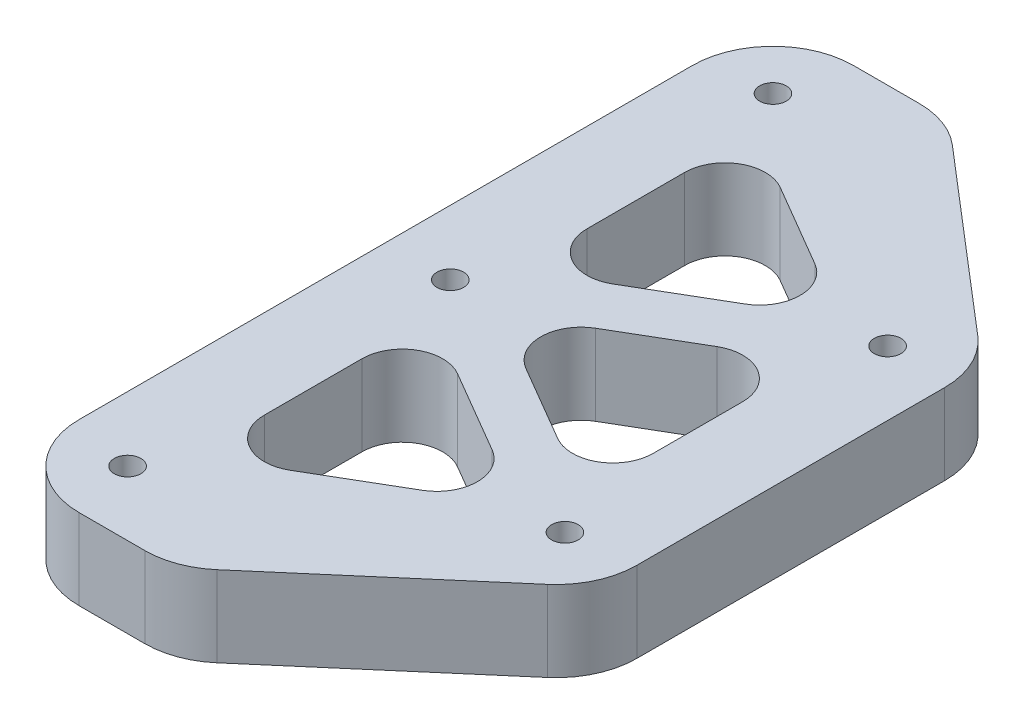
ISO-10303-21;
HEADER;
FILE_DESCRIPTION(('STEP AP214'),'2;1');
FILE_NAME('part.step','',(''),(''),'','','');
FILE_SCHEMA(('AUTOMOTIVE_DESIGN { 1 0 10303 214 1 1 1 1 }'));
ENDSEC;
DATA;
#1=APPLICATION_CONTEXT('core data for automotive mechanical design processes');
#2=APPLICATION_PROTOCOL_DEFINITION('international standard','automotive_design',2000,#1);
#3=PRODUCT_CONTEXT('',#1,'mechanical');
#4=PRODUCT('Part','Part','',(#3));
#5=PRODUCT_RELATED_PRODUCT_CATEGORY('part','',(#4));
#6=PRODUCT_DEFINITION_FORMATION('','',#4);
#7=PRODUCT_DEFINITION_CONTEXT('part definition',#1,'design');
#8=PRODUCT_DEFINITION('design','',#6,#7);
#9=PRODUCT_DEFINITION_SHAPE('','',#8);
#10=(LENGTH_UNIT() NAMED_UNIT(*) SI_UNIT(.MILLI.,.METRE.));
#11=(NAMED_UNIT(*) PLANE_ANGLE_UNIT() SI_UNIT($,.RADIAN.));
#12=(NAMED_UNIT(*) SI_UNIT($,.STERADIAN.) SOLID_ANGLE_UNIT());
#13=UNCERTAINTY_MEASURE_WITH_UNIT(LENGTH_MEASURE(1.E-05),#10,'distance_accuracy_value','');
#14=(GEOMETRIC_REPRESENTATION_CONTEXT(3) GLOBAL_UNCERTAINTY_ASSIGNED_CONTEXT((#13)) GLOBAL_UNIT_ASSIGNED_CONTEXT((#10,
#11,#12)) REPRESENTATION_CONTEXT('',''));
#15=CARTESIAN_POINT('',(0.,0.,0.));
#16=DIRECTION('',(0.,0.,1.));
#17=DIRECTION('',(1.,0.,0.));
#18=AXIS2_PLACEMENT_3D('',#15,#16,#17);
#19=CARTESIAN_POINT('',(17.,0.,-98.));
#20=DIRECTION('',(0.,1.,0.));
#21=DIRECTION('',(0.,0.,1.));
#22=AXIS2_PLACEMENT_3D('',#19,#20,#21);
#23=CYLINDRICAL_SURFACE('',#22,10.);
#24=CARTESIAN_POINT('',(17.,0.,-98.));
#25=DIRECTION('',(0.,-1.,0.));
#26=DIRECTION('',(0.,0.,-1.));
#27=AXIS2_PLACEMENT_3D('',#24,#25,#26);
#28=CIRCLE('',#27,10.);
#29=CARTESIAN_POINT('',(7.,0.,-98.));
#30=VERTEX_POINT('',#29);
#31=CARTESIAN_POINT('',(17.,0.,-108.));
#32=VERTEX_POINT('',#31);
#33=EDGE_CURVE('E409',#30,#32,#28,.T.);
#34=ORIENTED_EDGE('',*,*,#33,.F.);
#35=DIRECTION('',(0.,-1.,0.));
#36=VECTOR('',#35,1.);
#37=CARTESIAN_POINT('',(7.,0.,-98.));
#38=LINE('',#37,#36);
#39=CARTESIAN_POINT('',(7.,10.,-98.));
#40=VERTEX_POINT('',#39);
#41=EDGE_CURVE('E484',#40,#30,#38,.T.);
#42=ORIENTED_EDGE('',*,*,#41,.F.);
#43=CARTESIAN_POINT('',(17.,10.,-98.));
#44=DIRECTION('',(0.,1.,0.));
#45=DIRECTION('',(0.,0.,-1.));
#46=AXIS2_PLACEMENT_3D('',#43,#44,#45);
#47=CIRCLE('',#46,10.);
#48=CARTESIAN_POINT('',(17.,10.,-108.));
#49=VERTEX_POINT('',#48);
#50=EDGE_CURVE('E329',#49,#40,#47,.T.);
#51=ORIENTED_EDGE('',*,*,#50,.F.);
#52=DIRECTION('',(0.,1.,0.));
#53=VECTOR('',#52,1.);
#54=CARTESIAN_POINT('',(17.,0.,-108.));
#55=LINE('',#54,#53);
#56=EDGE_CURVE('E430',#32,#49,#55,.T.);
#57=ORIENTED_EDGE('',*,*,#56,.F.);
#58=EDGE_LOOP('',(#34,#42,#51,#57));
#59=FACE_BOUND('',#58,.T.);
#60=ADVANCED_FACE('F17',(#59),#23,.T.);
#61=CARTESIAN_POINT('',(25.1405946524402,0.,-98.));
#62=DIRECTION('',(0.,1.,0.));
#63=DIRECTION('',(0.,0.,1.));
#64=AXIS2_PLACEMENT_3D('',#61,#62,#63);
#65=CYLINDRICAL_SURFACE('',#64,10.);
#66=CARTESIAN_POINT('',(25.1405946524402,0.,-98.));
#67=DIRECTION('',(0.,-1.,0.));
#68=DIRECTION('',(0.,0.,-1.));
#69=AXIS2_PLACEMENT_3D('',#66,#67,#68);
#70=CIRCLE('',#69,10.);
#71=CARTESIAN_POINT('',(25.1405946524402,0.,-108.));
#72=VERTEX_POINT('',#71);
#73=CARTESIAN_POINT('',(31.6485083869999,0.,-105.592566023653));
#74=VERTEX_POINT('',#73);
#75=EDGE_CURVE('E417',#72,#74,#70,.T.);
#76=ORIENTED_EDGE('',*,*,#75,.F.);
#77=DIRECTION('',(0.,-1.,0.));
#78=VECTOR('',#77,1.);
#79=CARTESIAN_POINT('',(25.1405946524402,0.,-108.));
#80=LINE('',#79,#78);
#81=CARTESIAN_POINT('',(25.1405946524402,10.,-108.));
#82=VERTEX_POINT('',#81);
#83=EDGE_CURVE('E434',#82,#72,#80,.T.);
#84=ORIENTED_EDGE('',*,*,#83,.F.);
#85=CARTESIAN_POINT('',(25.1405946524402,10.,-98.));
#86=DIRECTION('',(0.,1.,0.));
#87=DIRECTION('',(0.,0.,-1.));
#88=AXIS2_PLACEMENT_3D('',#85,#86,#87);
#89=CIRCLE('',#88,10.);
#90=CARTESIAN_POINT('',(31.6485083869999,10.,-105.592566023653));
#91=VERTEX_POINT('',#90);
#92=EDGE_CURVE('E514',#91,#82,#89,.T.);
#93=ORIENTED_EDGE('',*,*,#92,.F.);
#94=DIRECTION('',(0.,1.,0.));
#95=VECTOR('',#94,1.);
#96=CARTESIAN_POINT('',(31.6485083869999,0.,-105.592566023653));
#97=LINE('',#96,#95);
#98=EDGE_CURVE('E346',#74,#91,#97,.T.);
#99=ORIENTED_EDGE('',*,*,#98,.F.);
#100=EDGE_LOOP('',(#76,#84,#93,#99));
#101=FACE_BOUND('',#100,.T.);
#102=ADVANCED_FACE('F19',(#101),#65,.T.);
#103=CARTESIAN_POINT('',(47.2137761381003,0.,-79.0801301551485));
#104=DIRECTION('',(0.,1.,0.));
#105=DIRECTION('',(0.,0.,1.));
#106=AXIS2_PLACEMENT_3D('',#103,#104,#105);
#107=CYLINDRICAL_SURFACE('',#106,10.);
#108=CARTESIAN_POINT('',(47.2137761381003,0.,-79.0801301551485));
#109=DIRECTION('',(0.,-1.,0.));
#110=DIRECTION('',(0.,0.,-1.));
#111=AXIS2_PLACEMENT_3D('',#108,#109,#110);
#112=CIRCLE('',#111,10.);
#113=CARTESIAN_POINT('',(53.72168987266,0.,-86.6726961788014));
#114=VERTEX_POINT('',#113);
#115=CARTESIAN_POINT('',(57.2137761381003,0.,-79.0801301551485));
#116=VERTEX_POINT('',#115);
#117=EDGE_CURVE('E422',#114,#116,#112,.T.);
#118=ORIENTED_EDGE('',*,*,#117,.F.);
#119=DIRECTION('',(0.,-1.,0.));
#120=VECTOR('',#119,1.);
#121=CARTESIAN_POINT('',(53.72168987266,0.,-86.6726961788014));
#122=LINE('',#121,#120);
#123=CARTESIAN_POINT('',(53.72168987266,10.,-86.6726961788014));
#124=VERTEX_POINT('',#123);
#125=EDGE_CURVE('E433',#124,#114,#122,.T.);
#126=ORIENTED_EDGE('',*,*,#125,.F.);
#127=CARTESIAN_POINT('',(47.2137761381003,10.,-79.0801301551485));
#128=DIRECTION('',(0.,1.,0.));
#129=DIRECTION('',(0.,0.,-1.));
#130=AXIS2_PLACEMENT_3D('',#127,#128,#129);
#131=CIRCLE('',#130,10.);
#132=CARTESIAN_POINT('',(57.2137761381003,10.,-79.0801301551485));
#133=VERTEX_POINT('',#132);
#134=EDGE_CURVE('E505',#133,#124,#131,.T.);
#135=ORIENTED_EDGE('',*,*,#134,.F.);
#136=DIRECTION('',(0.,1.,0.));
#137=VECTOR('',#136,1.);
#138=CARTESIAN_POINT('',(57.2137761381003,0.,-79.0801301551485));
#139=LINE('',#138,#137);
#140=EDGE_CURVE('E11',#116,#133,#139,.T.);
#141=ORIENTED_EDGE('',*,*,#140,.F.);
#142=EDGE_LOOP('',(#118,#126,#135,#141));
#143=FACE_BOUND('',#142,.T.);
#144=ADVANCED_FACE('F628',(#143),#107,.T.);
#145=CARTESIAN_POINT('',(47.2137761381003,0.,-40.9198698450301));
#146=DIRECTION('',(0.,1.,0.));
#147=DIRECTION('',(0.,0.,1.));
#148=AXIS2_PLACEMENT_3D('',#145,#146,#147);
#149=CYLINDRICAL_SURFACE('',#148,10.);
#150=CARTESIAN_POINT('',(47.2137761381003,0.,-40.9198698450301));
#151=DIRECTION('',(0.,-1.,0.));
#152=DIRECTION('',(0.,0.,-1.));
#153=AXIS2_PLACEMENT_3D('',#150,#151,#152);
#154=CIRCLE('',#153,10.);
#155=CARTESIAN_POINT('',(57.2137761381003,0.,-40.9198698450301));
#156=VERTEX_POINT('',#155);
#157=CARTESIAN_POINT('',(53.72168987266,0.,-33.3273038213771));
#158=VERTEX_POINT('',#157);
#159=EDGE_CURVE('E439',#156,#158,#154,.T.);
#160=ORIENTED_EDGE('',*,*,#159,.F.);
#161=DIRECTION('',(0.,-1.,0.));
#162=VECTOR('',#161,1.);
#163=CARTESIAN_POINT('',(57.2137761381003,0.,-40.9198698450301));
#164=LINE('',#163,#162);
#165=CARTESIAN_POINT('',(57.2137761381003,10.,-40.9198698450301));
#166=VERTEX_POINT('',#165);
#167=EDGE_CURVE('E26',#166,#156,#164,.T.);
#168=ORIENTED_EDGE('',*,*,#167,.F.);
#169=CARTESIAN_POINT('',(47.2137761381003,10.,-40.9198698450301));
#170=DIRECTION('',(0.,1.,0.));
#171=DIRECTION('',(0.,0.,-1.));
#172=AXIS2_PLACEMENT_3D('',#169,#170,#171);
#173=CIRCLE('',#172,10.);
#174=CARTESIAN_POINT('',(53.72168987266,10.,-33.3273038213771));
#175=VERTEX_POINT('',#174);
#176=EDGE_CURVE('E501',#175,#166,#173,.T.);
#177=ORIENTED_EDGE('',*,*,#176,.F.);
#178=DIRECTION('',(0.,1.,0.));
#179=VECTOR('',#178,1.);
#180=CARTESIAN_POINT('',(53.72168987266,0.,-33.3273038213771));
#181=LINE('',#180,#179);
#182=EDGE_CURVE('E399',#158,#175,#181,.T.);
#183=ORIENTED_EDGE('',*,*,#182,.F.);
#184=EDGE_LOOP('',(#160,#168,#177,#183));
#185=FACE_BOUND('',#184,.T.);
#186=ADVANCED_FACE('F622',(#185),#149,.T.);
#187=CARTESIAN_POINT('',(25.1405946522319,0.,-22.));
#188=DIRECTION('',(0.,1.,0.));
#189=DIRECTION('',(0.,0.,1.));
#190=AXIS2_PLACEMENT_3D('',#187,#188,#189);
#191=CYLINDRICAL_SURFACE('',#190,10.);
#192=CARTESIAN_POINT('',(25.1405946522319,0.,-22.));
#193=DIRECTION('',(0.,-1.,0.));
#194=DIRECTION('',(0.,0.,-1.));
#195=AXIS2_PLACEMENT_3D('',#192,#193,#194);
#196=CIRCLE('',#195,10.);
#197=CARTESIAN_POINT('',(31.6485083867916,0.,-14.407433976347));
#198=VERTEX_POINT('',#197);
#199=CARTESIAN_POINT('',(25.1405946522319,0.,-12.));
#200=VERTEX_POINT('',#199);
#201=EDGE_CURVE('E389',#198,#200,#196,.T.);
#202=ORIENTED_EDGE('',*,*,#201,.F.);
#203=DIRECTION('',(0.,-1.,0.));
#204=VECTOR('',#203,1.);
#205=CARTESIAN_POINT('',(31.6485083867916,0.,-14.407433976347));
#206=LINE('',#205,#204);
#207=CARTESIAN_POINT('',(31.6485083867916,10.,-14.407433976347));
#208=VERTEX_POINT('',#207);
#209=EDGE_CURVE('E478',#208,#198,#206,.T.);
#210=ORIENTED_EDGE('',*,*,#209,.F.);
#211=CARTESIAN_POINT('',(25.1405946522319,10.,-22.));
#212=DIRECTION('',(0.,1.,0.));
#213=DIRECTION('',(0.,0.,-1.));
#214=AXIS2_PLACEMENT_3D('',#211,#212,#213);
#215=CIRCLE('',#214,10.);
#216=CARTESIAN_POINT('',(25.1405946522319,10.,-12.));
#217=VERTEX_POINT('',#216);
#218=EDGE_CURVE('E603',#217,#208,#215,.T.);
#219=ORIENTED_EDGE('',*,*,#218,.F.);
#220=DIRECTION('',(0.,1.,0.));
#221=VECTOR('',#220,1.);
#222=CARTESIAN_POINT('',(25.1405946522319,0.,-12.));
#223=LINE('',#222,#221);
#224=EDGE_CURVE('E398',#200,#217,#223,.T.);
#225=ORIENTED_EDGE('',*,*,#224,.F.);
#226=EDGE_LOOP('',(#202,#210,#219,#225));
#227=FACE_BOUND('',#226,.T.);
#228=ADVANCED_FACE('F1615',(#227),#191,.T.);
#229=CARTESIAN_POINT('',(17.,0.,-22.));
#230=DIRECTION('',(0.,1.,0.));
#231=DIRECTION('',(0.,0.,1.));
#232=AXIS2_PLACEMENT_3D('',#229,#230,#231);
#233=CYLINDRICAL_SURFACE('',#232,10.);
#234=CARTESIAN_POINT('',(17.,0.,-22.));
#235=DIRECTION('',(0.,-1.,0.));
#236=DIRECTION('',(0.,0.,-1.));
#237=AXIS2_PLACEMENT_3D('',#234,#235,#236);
#238=CIRCLE('',#237,10.);
#239=CARTESIAN_POINT('',(17.,0.,-12.));
#240=VERTEX_POINT('',#239);
#241=CARTESIAN_POINT('',(7.,0.,-22.));
#242=VERTEX_POINT('',#241);
#243=EDGE_CURVE('E404',#240,#242,#238,.T.);
#244=ORIENTED_EDGE('',*,*,#243,.F.);
#245=DIRECTION('',(0.,-1.,0.));
#246=VECTOR('',#245,1.);
#247=CARTESIAN_POINT('',(17.,0.,-12.));
#248=LINE('',#247,#246);
#249=CARTESIAN_POINT('',(17.,10.,-12.));
#250=VERTEX_POINT('',#249);
#251=EDGE_CURVE('E395',#250,#240,#248,.T.);
#252=ORIENTED_EDGE('',*,*,#251,.F.);
#253=CARTESIAN_POINT('',(17.,10.,-22.));
#254=DIRECTION('',(0.,1.,0.));
#255=DIRECTION('',(0.,0.,-1.));
#256=AXIS2_PLACEMENT_3D('',#253,#254,#255);
#257=CIRCLE('',#256,10.);
#258=CARTESIAN_POINT('',(7.,10.,-22.));
#259=VERTEX_POINT('',#258);
#260=EDGE_CURVE('E592',#259,#250,#257,.T.);
#261=ORIENTED_EDGE('',*,*,#260,.F.);
#262=DIRECTION('',(0.,1.,0.));
#263=VECTOR('',#262,1.);
#264=CARTESIAN_POINT('',(7.,0.,-22.));
#265=LINE('',#264,#263);
#266=EDGE_CURVE('E481',#242,#259,#265,.T.);
#267=ORIENTED_EDGE('',*,*,#266,.F.);
#268=EDGE_LOOP('',(#244,#252,#261,#267));
#269=FACE_BOUND('',#268,.T.);
#270=ADVANCED_FACE('F641',(#269),#233,.T.);
#271=CARTESIAN_POINT('',(57.2137761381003,0.,-36.320520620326));
#272=DIRECTION('',(1.,0.,0.));
#273=DIRECTION('',(0.,1.,0.));
#274=AXIS2_PLACEMENT_3D('',#271,#272,#273);
#275=PLANE('',#274);
#276=DIRECTION('',(0.,0.,-1.));
#277=VECTOR('',#276,1.);
#278=CARTESIAN_POINT('',(57.2137761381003,10.,-36.320520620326));
#279=LINE('',#278,#277);
#280=EDGE_CURVE('E510',#166,#133,#279,.T.);
#281=ORIENTED_EDGE('',*,*,#280,.F.);
#282=ORIENTED_EDGE('',*,*,#167,.T.);
#283=DIRECTION('',(0.,0.,-1.));
#284=VECTOR('',#283,1.);
#285=CARTESIAN_POINT('',(57.2137761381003,0.,-36.320520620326));
#286=LINE('',#285,#284);
#287=EDGE_CURVE('E429',#156,#116,#286,.T.);
#288=ORIENTED_EDGE('',*,*,#287,.T.);
#289=ORIENTED_EDGE('',*,*,#140,.T.);
#290=EDGE_LOOP('',(#281,#282,#288,#289));
#291=FACE_BOUND('',#290,.T.);
#292=ADVANCED_FACE('F625',(#291),#275,.T.);
#293=CARTESIAN_POINT('',(57.2137761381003,0.,-83.6794793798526));
#294=DIRECTION('',(0.650791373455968,0.,-0.759256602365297));
#295=DIRECTION('',(0.,-1.,0.));
#296=AXIS2_PLACEMENT_3D('',#293,#294,#295);
#297=PLANE('',#296);
#298=DIRECTION('',(-0.759256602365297,0.,-0.650791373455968));
#299=VECTOR('',#298,1.);
#300=CARTESIAN_POINT('',(57.2137761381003,10.,-83.6794793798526));
#301=LINE('',#300,#299);
#302=EDGE_CURVE('E509',#124,#91,#301,.T.);
#303=ORIENTED_EDGE('',*,*,#302,.F.);
#304=ORIENTED_EDGE('',*,*,#125,.T.);
#305=DIRECTION('',(-0.759256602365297,0.,-0.650791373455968));
#306=VECTOR('',#305,1.);
#307=CARTESIAN_POINT('',(57.2137761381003,0.,-83.6794793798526));
#308=LINE('',#307,#306);
#309=EDGE_CURVE('E418',#114,#74,#308,.T.);
#310=ORIENTED_EDGE('',*,*,#309,.T.);
#311=ORIENTED_EDGE('',*,*,#98,.T.);
#312=EDGE_LOOP('',(#303,#304,#310,#311));
#313=FACE_BOUND('',#312,.T.);
#314=ADVANCED_FACE('F629',(#313),#297,.T.);
#315=CARTESIAN_POINT('',(28.839835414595,0.,-108.));
#316=DIRECTION('',(0.,0.,-1.));
#317=DIRECTION('',(0.,-1.,0.));
#318=AXIS2_PLACEMENT_3D('',#315,#316,#317);
#319=PLANE('',#318);
#320=DIRECTION('',(-1.,0.,0.));
#321=VECTOR('',#320,1.);
#322=CARTESIAN_POINT('',(28.839835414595,10.,-108.));
#323=LINE('',#322,#321);
#324=EDGE_CURVE('E339',#82,#49,#323,.T.);
#325=ORIENTED_EDGE('',*,*,#324,.F.);
#326=ORIENTED_EDGE('',*,*,#83,.T.);
#327=DIRECTION('',(-1.,0.,0.));
#328=VECTOR('',#327,1.);
#329=CARTESIAN_POINT('',(28.839835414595,0.,-108.));
#330=LINE('',#329,#328);
#331=EDGE_CURVE('E413',#72,#32,#330,.T.);
#332=ORIENTED_EDGE('',*,*,#331,.T.);
#333=ORIENTED_EDGE('',*,*,#56,.T.);
#334=EDGE_LOOP('',(#325,#326,#332,#333));
#335=FACE_BOUND('',#334,.T.);
#336=ADVANCED_FACE('F631',(#335),#319,.T.);
#337=CARTESIAN_POINT('',(7.,0.,-108.));
#338=DIRECTION('',(-1.,0.,0.));
#339=DIRECTION('',(0.,1.,0.));
#340=AXIS2_PLACEMENT_3D('',#337,#338,#339);
#341=PLANE('',#340);
#342=DIRECTION('',(0.,0.,1.));
#343=VECTOR('',#342,1.);
#344=CARTESIAN_POINT('',(7.,0.,-108.));
#345=LINE('',#344,#343);
#346=EDGE_CURVE('E408',#30,#242,#345,.T.);
#347=ORIENTED_EDGE('',*,*,#346,.T.);
#348=ORIENTED_EDGE('',*,*,#266,.T.);
#349=DIRECTION('',(0.,0.,1.));
#350=VECTOR('',#349,1.);
#351=CARTESIAN_POINT('',(7.,10.,-108.));
#352=LINE('',#351,#350);
#353=EDGE_CURVE('E582',#40,#259,#352,.T.);
#354=ORIENTED_EDGE('',*,*,#353,.F.);
#355=ORIENTED_EDGE('',*,*,#41,.T.);
#356=EDGE_LOOP('',(#347,#348,#354,#355));
#357=FACE_BOUND('',#356,.T.);
#358=ADVANCED_FACE('F638',(#357),#341,.T.);
#359=CARTESIAN_POINT('',(7.,0.,-12.));
#360=DIRECTION('',(0.,0.,1.));
#361=DIRECTION('',(1.,0.,0.));
#362=AXIS2_PLACEMENT_3D('',#359,#360,#361);
#363=PLANE('',#362);
#364=DIRECTION('',(1.,0.,0.));
#365=VECTOR('',#364,1.);
#366=CARTESIAN_POINT('',(7.,10.,-12.));
#367=LINE('',#366,#365);
#368=EDGE_CURVE('E599',#250,#217,#367,.T.);
#369=ORIENTED_EDGE('',*,*,#368,.F.);
#370=ORIENTED_EDGE('',*,*,#251,.T.);
#371=DIRECTION('',(1.,0.,0.));
#372=VECTOR('',#371,1.);
#373=CARTESIAN_POINT('',(7.,0.,-12.));
#374=LINE('',#373,#372);
#375=EDGE_CURVE('E403',#240,#200,#374,.T.);
#376=ORIENTED_EDGE('',*,*,#375,.T.);
#377=ORIENTED_EDGE('',*,*,#224,.T.);
#378=EDGE_LOOP('',(#369,#370,#376,#377));
#379=FACE_BOUND('',#378,.T.);
#380=ADVANCED_FACE('F682',(#379),#363,.T.);
#381=CARTESIAN_POINT('',(28.8398354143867,0.,-12.));
#382=DIRECTION('',(0.650791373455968,0.,0.759256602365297));
#383=DIRECTION('',(0.,-1.,0.));
#384=AXIS2_PLACEMENT_3D('',#381,#382,#383);
#385=PLANE('',#384);
#386=DIRECTION('',(0.759256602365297,0.,-0.650791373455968));
#387=VECTOR('',#386,1.);
#388=CARTESIAN_POINT('',(28.8398354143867,10.,-12.));
#389=LINE('',#388,#387);
#390=EDGE_CURVE('E604',#208,#175,#389,.T.);
#391=ORIENTED_EDGE('',*,*,#390,.F.);
#392=ORIENTED_EDGE('',*,*,#209,.T.);
#393=DIRECTION('',(0.759256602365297,0.,-0.650791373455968));
#394=VECTOR('',#393,1.);
#395=CARTESIAN_POINT('',(28.8398354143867,0.,-12.));
#396=LINE('',#395,#394);
#397=EDGE_CURVE('E435',#198,#158,#396,.T.);
#398=ORIENTED_EDGE('',*,*,#397,.T.);
#399=ORIENTED_EDGE('',*,*,#182,.T.);
#400=EDGE_LOOP('',(#391,#392,#398,#399));
#401=FACE_BOUND('',#400,.T.);
#402=ADVANCED_FACE('F725',(#401),#385,.T.);
#403=CARTESIAN_POINT('',(23.,0.,-33.9430561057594));
#404=DIRECTION('',(0.,-1.,0.));
#405=DIRECTION('',(0.,0.,-1.));
#406=AXIS2_PLACEMENT_3D('',#403,#404,#405);
#407=CYLINDRICAL_SURFACE('',#406,5.);
#408=CARTESIAN_POINT('',(23.,0.,-33.9430561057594));
#409=DIRECTION('',(0.,1.,0.));
#410=DIRECTION('',(0.,0.,-1.));
#411=AXIS2_PLACEMENT_3D('',#408,#409,#410);
#412=CIRCLE('',#411,5.);
#413=CARTESIAN_POINT('',(18.,0.,-33.9430561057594));
#414=VERTEX_POINT('',#413);
#415=CARTESIAN_POINT('',(25.5233042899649,0.,-29.6264677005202));
#416=VERTEX_POINT('',#415);
#417=EDGE_CURVE('E360',#414,#416,#412,.T.);
#418=ORIENTED_EDGE('',*,*,#417,.F.);
#419=DIRECTION('',(0.,-1.,0.));
#420=VECTOR('',#419,1.);
#421=CARTESIAN_POINT('',(18.,0.,-33.9430561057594));
#422=LINE('',#421,#420);
#423=CARTESIAN_POINT('',(18.,10.,-33.9430561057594));
#424=VERTEX_POINT('',#423);
#425=EDGE_CURVE('E463',#424,#414,#422,.T.);
#426=ORIENTED_EDGE('',*,*,#425,.F.);
#427=CARTESIAN_POINT('',(23.,10.,-33.9430561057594));
#428=DIRECTION('',(0.,-1.,0.));
#429=DIRECTION('',(0.,0.,-1.));
#430=AXIS2_PLACEMENT_3D('',#427,#428,#429);
#431=CIRCLE('',#430,5.);
#432=CARTESIAN_POINT('',(25.5233042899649,10.,-29.6264677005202));
#433=VERTEX_POINT('',#432);
#434=EDGE_CURVE('E365',#433,#424,#431,.T.);
#435=ORIENTED_EDGE('',*,*,#434,.F.);
#436=DIRECTION('',(0.,1.,0.));
#437=VECTOR('',#436,1.);
#438=CARTESIAN_POINT('',(25.5233042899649,10.,-29.6264677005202));
#439=LINE('',#438,#437);
#440=EDGE_CURVE('E349',#416,#433,#439,.T.);
#441=ORIENTED_EDGE('',*,*,#440,.F.);
#442=EDGE_LOOP('',(#418,#426,#435,#441));
#443=FACE_BOUND('',#442,.T.);
#444=ADVANCED_FACE('F721',(#443),#407,.F.);
#445=CARTESIAN_POINT('',(33.3615461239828,0.,-40.0000000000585));
#446=DIRECTION('',(0.,-1.,0.));
#447=DIRECTION('',(0.,0.,-1.));
#448=AXIS2_PLACEMENT_3D('',#445,#446,#447);
#449=CYLINDRICAL_SURFACE('',#448,5.);
#450=CARTESIAN_POINT('',(33.3615461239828,0.,-40.0000000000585));
#451=DIRECTION('',(0.,1.,0.));
#452=DIRECTION('',(0.,0.,-1.));
#453=AXIS2_PLACEMENT_3D('',#450,#451,#452);
#454=CIRCLE('',#453,5.);
#455=CARTESIAN_POINT('',(35.8848504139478,0.,-35.6834115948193));
#456=VERTEX_POINT('',#455);
#457=CARTESIAN_POINT('',(35.884850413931,0.,-44.3165884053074));
#458=VERTEX_POINT('',#457);
#459=EDGE_CURVE('E455',#456,#458,#454,.T.);
#460=ORIENTED_EDGE('',*,*,#459,.F.);
#461=DIRECTION('',(0.,-1.,0.));
#462=VECTOR('',#461,1.);
#463=CARTESIAN_POINT('',(35.8848504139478,0.,-35.6834115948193));
#464=LINE('',#463,#462);
#465=CARTESIAN_POINT('',(35.8848504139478,10.,-35.6834115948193));
#466=VERTEX_POINT('',#465);
#467=EDGE_CURVE('E347',#466,#456,#464,.T.);
#468=ORIENTED_EDGE('',*,*,#467,.F.);
#469=CARTESIAN_POINT('',(33.3615461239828,10.,-40.0000000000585));
#470=DIRECTION('',(0.,-1.,0.));
#471=DIRECTION('',(0.,0.,-1.));
#472=AXIS2_PLACEMENT_3D('',#469,#470,#471);
#473=CIRCLE('',#472,5.);
#474=CARTESIAN_POINT('',(35.884850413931,10.,-44.3165884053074));
#475=VERTEX_POINT('',#474);
#476=EDGE_CURVE('E379',#475,#466,#473,.T.);
#477=ORIENTED_EDGE('',*,*,#476,.F.);
#478=DIRECTION('',(0.,1.,0.));
#479=VECTOR('',#478,1.);
#480=CARTESIAN_POINT('',(35.884850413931,10.,-44.3165884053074));
#481=LINE('',#480,#479);
#482=EDGE_CURVE('E350',#458,#475,#481,.T.);
#483=ORIENTED_EDGE('',*,*,#482,.F.);
#484=EDGE_LOOP('',(#460,#468,#477,#483));
#485=FACE_BOUND('',#484,.T.);
#486=ADVANCED_FACE('F718',(#485),#449,.F.);
#487=CARTESIAN_POINT('',(23.,0.,-73.9430561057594));
#488=DIRECTION('',(0.,-1.,0.));
#489=DIRECTION('',(0.,0.,-1.));
#490=AXIS2_PLACEMENT_3D('',#487,#488,#489);
#491=CYLINDRICAL_SURFACE('',#490,5.);
#492=CARTESIAN_POINT('',(23.,0.,-73.9430561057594));
#493=DIRECTION('',(0.,1.,0.));
#494=DIRECTION('',(0.,0.,-1.));
#495=AXIS2_PLACEMENT_3D('',#492,#493,#494);
#496=CIRCLE('',#495,5.);
#497=CARTESIAN_POINT('',(18.,0.,-73.9430561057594));
#498=VERTEX_POINT('',#497);
#499=CARTESIAN_POINT('',(25.5233042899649,0.,-69.6264677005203));
#500=VERTEX_POINT('',#499);
#501=EDGE_CURVE('E303',#498,#500,#496,.T.);
#502=ORIENTED_EDGE('',*,*,#501,.F.);
#503=DIRECTION('',(0.,-1.,0.));
#504=VECTOR('',#503,1.);
#505=CARTESIAN_POINT('',(18.,0.,-73.9430561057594));
#506=LINE('',#505,#504);
#507=CARTESIAN_POINT('',(18.,10.,-73.9430561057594));
#508=VERTEX_POINT('',#507);
#509=EDGE_CURVE('E297',#508,#498,#506,.T.);
#510=ORIENTED_EDGE('',*,*,#509,.F.);
#511=CARTESIAN_POINT('',(23.,10.,-73.9430561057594));
#512=DIRECTION('',(0.,-1.,0.));
#513=DIRECTION('',(0.,0.,-1.));
#514=AXIS2_PLACEMENT_3D('',#511,#512,#513);
#515=CIRCLE('',#514,5.);
#516=CARTESIAN_POINT('',(25.5233042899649,10.,-69.6264677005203));
#517=VERTEX_POINT('',#516);
#518=EDGE_CURVE('E300',#517,#508,#515,.T.);
#519=ORIENTED_EDGE('',*,*,#518,.F.);
#520=DIRECTION('',(0.,1.,0.));
#521=VECTOR('',#520,1.);
#522=CARTESIAN_POINT('',(25.5233042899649,10.,-69.6264677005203));
#523=LINE('',#522,#521);
#524=EDGE_CURVE('E310',#500,#517,#523,.T.);
#525=ORIENTED_EDGE('',*,*,#524,.F.);
#526=EDGE_LOOP('',(#502,#510,#519,#525));
#527=FACE_BOUND('',#526,.T.);
#528=ADVANCED_FACE('F299',(#527),#491,.F.);
#529=CARTESIAN_POINT('',(33.3615461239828,0.,-80.0000000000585));
#530=DIRECTION('',(0.,-1.,0.));
#531=DIRECTION('',(0.,0.,-1.));
#532=AXIS2_PLACEMENT_3D('',#529,#530,#531);
#533=CYLINDRICAL_SURFACE('',#532,5.);
#534=CARTESIAN_POINT('',(33.3615461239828,0.,-80.0000000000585));
#535=DIRECTION('',(0.,1.,0.));
#536=DIRECTION('',(0.,0.,-1.));
#537=AXIS2_PLACEMENT_3D('',#534,#535,#536);
#538=CIRCLE('',#537,5.);
#539=CARTESIAN_POINT('',(35.8848504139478,0.,-75.6834115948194));
#540=VERTEX_POINT('',#539);
#541=CARTESIAN_POINT('',(35.884850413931,0.,-84.3165884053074));
#542=VERTEX_POINT('',#541);
#543=EDGE_CURVE('E388',#540,#542,#538,.T.);
#544=ORIENTED_EDGE('',*,*,#543,.F.);
#545=DIRECTION('',(0.,-1.,0.));
#546=VECTOR('',#545,1.);
#547=CARTESIAN_POINT('',(35.8848504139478,0.,-75.6834115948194));
#548=LINE('',#547,#546);
#549=CARTESIAN_POINT('',(35.8848504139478,10.,-75.6834115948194));
#550=VERTEX_POINT('',#549);
#551=EDGE_CURVE('E462',#550,#540,#548,.T.);
#552=ORIENTED_EDGE('',*,*,#551,.F.);
#553=CARTESIAN_POINT('',(33.3615461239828,10.,-80.0000000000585));
#554=DIRECTION('',(0.,-1.,0.));
#555=DIRECTION('',(0.,0.,-1.));
#556=AXIS2_PLACEMENT_3D('',#553,#554,#555);
#557=CIRCLE('',#556,5.);
#558=CARTESIAN_POINT('',(35.884850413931,10.,-84.3165884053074));
#559=VERTEX_POINT('',#558);
#560=EDGE_CURVE('E336',#559,#550,#557,.T.);
#561=ORIENTED_EDGE('',*,*,#560,.F.);
#562=DIRECTION('',(0.,1.,0.));
#563=VECTOR('',#562,1.);
#564=CARTESIAN_POINT('',(35.884850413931,10.,-84.3165884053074));
#565=LINE('',#564,#563);
#566=EDGE_CURVE('E447',#542,#559,#565,.T.);
#567=ORIENTED_EDGE('',*,*,#566,.F.);
#568=EDGE_LOOP('',(#544,#552,#561,#567));
#569=FACE_BOUND('',#568,.T.);
#570=ADVANCED_FACE('F712',(#569),#533,.F.);
#571=CARTESIAN_POINT('',(31.7238715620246,0.,-59.4904733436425));
#572=DIRECTION('',(0.,-1.,0.));
#573=DIRECTION('',(0.,0.,-1.));
#574=AXIS2_PLACEMENT_3D('',#571,#572,#573);
#575=CYLINDRICAL_SURFACE('',#574,5.);
#576=CARTESIAN_POINT('',(31.7238715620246,0.,-59.4904733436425));
#577=DIRECTION('',(0.,1.,0.));
#578=DIRECTION('',(0.,0.,-1.));
#579=AXIS2_PLACEMENT_3D('',#576,#577,#578);
#580=CIRCLE('',#579,5.);
#581=CARTESIAN_POINT('',(29.2005672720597,0.,-63.8070617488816));
#582=VERTEX_POINT('',#581);
#583=CARTESIAN_POINT('',(29.2005672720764,0.,-55.1738849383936));
#584=VERTEX_POINT('',#583);
#585=EDGE_CURVE('E444',#582,#584,#580,.T.);
#586=ORIENTED_EDGE('',*,*,#585,.F.);
#587=DIRECTION('',(0.,-1.,0.));
#588=VECTOR('',#587,1.);
#589=CARTESIAN_POINT('',(29.2005672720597,0.,-63.8070617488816));
#590=LINE('',#589,#588);
#591=CARTESIAN_POINT('',(29.2005672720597,10.,-63.8070617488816));
#592=VERTEX_POINT('',#591);
#593=EDGE_CURVE('E39',#592,#582,#590,.T.);
#594=ORIENTED_EDGE('',*,*,#593,.F.);
#595=CARTESIAN_POINT('',(31.7238715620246,10.,-59.4904733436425));
#596=DIRECTION('',(0.,-1.,0.));
#597=DIRECTION('',(0.,0.,-1.));
#598=AXIS2_PLACEMENT_3D('',#595,#596,#597);
#599=CIRCLE('',#598,5.);
#600=CARTESIAN_POINT('',(29.2005672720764,10.,-55.1738849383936));
#601=VERTEX_POINT('',#600);
#602=EDGE_CURVE('E393',#601,#592,#599,.T.);
#603=ORIENTED_EDGE('',*,*,#602,.F.);
#604=DIRECTION('',(0.,1.,0.));
#605=VECTOR('',#604,1.);
#606=CARTESIAN_POINT('',(29.2005672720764,10.,-55.1738849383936));
#607=LINE('',#606,#605);
#608=EDGE_CURVE('E289',#584,#601,#607,.T.);
#609=ORIENTED_EDGE('',*,*,#608,.F.);
#610=EDGE_LOOP('',(#586,#594,#603,#609));
#611=FACE_BOUND('',#610,.T.);
#612=ADVANCED_FACE('F710',(#611),#575,.F.);
#613=CARTESIAN_POINT('',(41.2137761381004,0.,-53.9430561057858));
#614=DIRECTION('',(0.,-1.,0.));
#615=DIRECTION('',(0.,0.,-1.));
#616=AXIS2_PLACEMENT_3D('',#613,#614,#615);
#617=CYLINDRICAL_SURFACE('',#616,5.);
#618=CARTESIAN_POINT('',(41.2137761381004,0.,-53.9430561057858));
#619=DIRECTION('',(0.,1.,0.));
#620=DIRECTION('',(0.,0.,-1.));
#621=AXIS2_PLACEMENT_3D('',#618,#619,#620);
#622=CIRCLE('',#621,5.);
#623=CARTESIAN_POINT('',(38.6904718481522,0.,-49.6264677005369));
#624=VERTEX_POINT('',#623);
#625=CARTESIAN_POINT('',(46.2137761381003,0.,-53.9430561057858));
#626=VERTEX_POINT('',#625);
#627=EDGE_CURVE('E370',#624,#626,#622,.T.);
#628=ORIENTED_EDGE('',*,*,#627,.F.);
#629=DIRECTION('',(0.,-1.,0.));
#630=VECTOR('',#629,1.);
#631=CARTESIAN_POINT('',(38.6904718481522,0.,-49.6264677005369));
#632=LINE('',#631,#630);
#633=CARTESIAN_POINT('',(38.6904718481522,10.,-49.6264677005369));
#634=VERTEX_POINT('',#633);
#635=EDGE_CURVE('E278',#634,#624,#632,.T.);
#636=ORIENTED_EDGE('',*,*,#635,.F.);
#637=CARTESIAN_POINT('',(41.2137761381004,10.,-53.9430561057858));
#638=DIRECTION('',(0.,-1.,0.));
#639=DIRECTION('',(0.,0.,-1.));
#640=AXIS2_PLACEMENT_3D('',#637,#638,#639);
#641=CIRCLE('',#640,5.);
#642=CARTESIAN_POINT('',(46.2137761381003,10.,-53.9430561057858));
#643=VERTEX_POINT('',#642);
#644=EDGE_CURVE('E394',#643,#634,#641,.T.);
#645=ORIENTED_EDGE('',*,*,#644,.F.);
#646=DIRECTION('',(0.,1.,0.));
#647=VECTOR('',#646,1.);
#648=CARTESIAN_POINT('',(46.2137761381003,10.,-53.9430561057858));
#649=LINE('',#648,#647);
#650=EDGE_CURVE('E469',#626,#643,#649,.T.);
#651=ORIENTED_EDGE('',*,*,#650,.F.);
#652=EDGE_LOOP('',(#628,#636,#645,#651));
#653=FACE_BOUND('',#652,.T.);
#654=ADVANCED_FACE('F707',(#653),#617,.F.);
#655=CARTESIAN_POINT('',(46.2137761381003,0.,-73.7523006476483));
#656=DIRECTION('',(-0.504660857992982,0.,-0.863317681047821));
#657=DIRECTION('',(-0.863317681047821,0.,0.504660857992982));
#658=AXIS2_PLACEMENT_3D('',#655,#656,#657);
#659=PLANE('',#658);
#660=DIRECTION('',(-0.863317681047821,0.,0.504660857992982));
#661=VECTOR('',#660,1.);
#662=CARTESIAN_POINT('',(46.2137761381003,0.,-73.7523006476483));
#663=LINE('',#662,#661);
#664=CARTESIAN_POINT('',(38.6904718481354,0.,-69.3544789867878));
#665=VERTEX_POINT('',#664);
#666=EDGE_CURVE('E369',#665,#582,#663,.T.);
#667=ORIENTED_EDGE('',*,*,#666,.F.);
#668=DIRECTION('',(0.,1.,0.));
#669=VECTOR('',#668,1.);
#670=CARTESIAN_POINT('',(38.6904718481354,10.,-69.3544789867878));
#671=LINE('',#670,#669);
#672=CARTESIAN_POINT('',(38.6904718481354,10.,-69.3544789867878));
#673=VERTEX_POINT('',#672);
#674=EDGE_CURVE('E474',#665,#673,#671,.T.);
#675=ORIENTED_EDGE('',*,*,#674,.T.);
#676=DIRECTION('',(-0.863317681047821,0.,0.504660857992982));
#677=VECTOR('',#676,1.);
#678=CARTESIAN_POINT('',(46.2137761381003,10.,-73.7523006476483));
#679=LINE('',#678,#677);
#680=EDGE_CURVE('E383',#673,#592,#679,.T.);
#681=ORIENTED_EDGE('',*,*,#680,.T.);
#682=ORIENTED_EDGE('',*,*,#593,.T.);
#683=EDGE_LOOP('',(#667,#675,#681,#682));
#684=FACE_BOUND('',#683,.T.);
#685=ADVANCED_FACE('F704',(#684),#659,.F.);
#686=CARTESIAN_POINT('',(21.8162278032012,0.,-59.4904733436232));
#687=DIRECTION('',(-0.504660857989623,0.,0.863317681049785));
#688=DIRECTION('',(0.,1.,0.));
#689=AXIS2_PLACEMENT_3D('',#686,#687,#688);
#690=PLANE('',#689);
#691=DIRECTION('',(0.863317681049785,0.,0.504660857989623));
#692=VECTOR('',#691,1.);
#693=CARTESIAN_POINT('',(21.8162278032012,10.,-59.4904733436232));
#694=LINE('',#693,#692);
#695=EDGE_CURVE('E390',#601,#634,#694,.T.);
#696=ORIENTED_EDGE('',*,*,#695,.T.);
#697=ORIENTED_EDGE('',*,*,#635,.T.);
#698=DIRECTION('',(0.863317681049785,0.,0.504660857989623));
#699=VECTOR('',#698,1.);
#700=CARTESIAN_POINT('',(21.8162278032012,0.,-59.4904733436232));
#701=LINE('',#700,#699);
#702=EDGE_CURVE('E456',#584,#624,#701,.T.);
#703=ORIENTED_EDGE('',*,*,#702,.F.);
#704=ORIENTED_EDGE('',*,*,#608,.T.);
#705=EDGE_LOOP('',(#696,#697,#703,#704));
#706=FACE_BOUND('',#705,.T.);
#707=ADVANCED_FACE('F671',(#706),#690,.F.);
#708=CARTESIAN_POINT('',(46.2137761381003,0.,-45.2286460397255));
#709=DIRECTION('',(1.,0.,0.));
#710=DIRECTION('',(0.,1.,0.));
#711=AXIS2_PLACEMENT_3D('',#708,#709,#710);
#712=PLANE('',#711);
#713=DIRECTION('',(0.,0.,-1.));
#714=VECTOR('',#713,1.);
#715=CARTESIAN_POINT('',(46.2137761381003,0.,-45.2286460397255));
#716=LINE('',#715,#714);
#717=CARTESIAN_POINT('',(46.2137761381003,0.,-65.0378905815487));
#718=VERTEX_POINT('',#717);
#719=EDGE_CURVE('E366',#626,#718,#716,.T.);
#720=ORIENTED_EDGE('',*,*,#719,.F.);
#721=ORIENTED_EDGE('',*,*,#650,.T.);
#722=DIRECTION('',(0.,0.,-1.));
#723=VECTOR('',#722,1.);
#724=CARTESIAN_POINT('',(46.2137761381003,10.,-45.2286460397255));
#725=LINE('',#724,#723);
#726=CARTESIAN_POINT('',(46.2137761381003,10.,-65.0378905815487));
#727=VERTEX_POINT('',#726);
#728=EDGE_CURVE('E343',#643,#727,#725,.T.);
#729=ORIENTED_EDGE('',*,*,#728,.T.);
#730=DIRECTION('',(0.,-1.,0.));
#731=VECTOR('',#730,1.);
#732=CARTESIAN_POINT('',(46.2137761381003,0.,-65.0378905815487));
#733=LINE('',#732,#731);
#734=EDGE_CURVE('E773',#727,#718,#733,.T.);
#735=ORIENTED_EDGE('',*,*,#734,.T.);
#736=EDGE_LOOP('',(#720,#721,#729,#735));
#737=FACE_BOUND('',#736,.T.);
#738=ADVANCED_FACE('F667',(#737),#712,.F.);
#739=CARTESIAN_POINT('',(18.,0.,-25.2286460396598));
#740=DIRECTION('',(0.504660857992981,0.,0.863317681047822));
#741=DIRECTION('',(0.,-1.,0.));
#742=AXIS2_PLACEMENT_3D('',#739,#740,#741);
#743=PLANE('',#742);
#744=DIRECTION('',(0.863317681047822,0.,-0.504660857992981));
#745=VECTOR('',#744,1.);
#746=CARTESIAN_POINT('',(18.,10.,-25.2286460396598));
#747=LINE('',#746,#745);
#748=EDGE_CURVE('E322',#433,#466,#747,.T.);
#749=ORIENTED_EDGE('',*,*,#748,.T.);
#750=ORIENTED_EDGE('',*,*,#467,.T.);
#751=DIRECTION('',(0.863317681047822,0.,-0.504660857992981));
#752=VECTOR('',#751,1.);
#753=CARTESIAN_POINT('',(18.,0.,-25.2286460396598));
#754=LINE('',#753,#752);
#755=EDGE_CURVE('E451',#416,#456,#754,.T.);
#756=ORIENTED_EDGE('',*,*,#755,.F.);
#757=ORIENTED_EDGE('',*,*,#440,.T.);
#758=EDGE_LOOP('',(#749,#750,#756,#757));
#759=FACE_BOUND('',#758,.T.);
#760=ADVANCED_FACE('F670',(#759),#743,.F.);
#761=CARTESIAN_POINT('',(43.2691898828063,0.,-40.0000000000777));
#762=DIRECTION('',(0.504660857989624,0.,-0.863317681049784));
#763=DIRECTION('',(0.,-1.,0.));
#764=AXIS2_PLACEMENT_3D('',#761,#762,#763);
#765=PLANE('',#764);
#766=DIRECTION('',(-0.863317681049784,0.,-0.504660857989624));
#767=VECTOR('',#766,1.);
#768=CARTESIAN_POINT('',(43.2691898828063,0.,-40.0000000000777));
#769=LINE('',#768,#767);
#770=CARTESIAN_POINT('',(25.5233042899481,0.,-50.3735322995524));
#771=VERTEX_POINT('',#770);
#772=EDGE_CURVE('E361',#458,#771,#769,.T.);
#773=ORIENTED_EDGE('',*,*,#772,.F.);
#774=ORIENTED_EDGE('',*,*,#482,.T.);
#775=DIRECTION('',(-0.863317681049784,0.,-0.504660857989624));
#776=VECTOR('',#775,1.);
#777=CARTESIAN_POINT('',(43.2691898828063,10.,-40.0000000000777));
#778=LINE('',#777,#776);
#779=CARTESIAN_POINT('',(25.5233042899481,10.,-50.3735322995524));
#780=VERTEX_POINT('',#779);
#781=EDGE_CURVE('E375',#475,#780,#778,.T.);
#782=ORIENTED_EDGE('',*,*,#781,.T.);
#783=DIRECTION('',(0.,-1.,0.));
#784=VECTOR('',#783,1.);
#785=CARTESIAN_POINT('',(25.5233042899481,0.,-50.3735322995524));
#786=LINE('',#785,#784);
#787=EDGE_CURVE('E753',#780,#771,#786,.T.);
#788=ORIENTED_EDGE('',*,*,#787,.T.);
#789=EDGE_LOOP('',(#773,#774,#782,#788));
#790=FACE_BOUND('',#789,.T.);
#791=ADVANCED_FACE('F696',(#790),#765,.F.);
#792=CARTESIAN_POINT('',(18.,0.,-54.7713539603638));
#793=DIRECTION('',(-1.,0.,0.));
#794=DIRECTION('',(0.,1.,0.));
#795=AXIS2_PLACEMENT_3D('',#792,#793,#794);
#796=PLANE('',#795);
#797=DIRECTION('',(0.,0.,1.));
#798=VECTOR('',#797,1.);
#799=CARTESIAN_POINT('',(18.,10.,-54.7713539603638));
#800=LINE('',#799,#798);
#801=CARTESIAN_POINT('',(18.,10.,-46.0569438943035));
#802=VERTEX_POINT('',#801);
#803=EDGE_CURVE('E374',#802,#424,#800,.T.);
#804=ORIENTED_EDGE('',*,*,#803,.T.);
#805=ORIENTED_EDGE('',*,*,#425,.T.);
#806=DIRECTION('',(0.,0.,1.));
#807=VECTOR('',#806,1.);
#808=CARTESIAN_POINT('',(18.,0.,-54.7713539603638));
#809=LINE('',#808,#807);
#810=CARTESIAN_POINT('',(18.,0.,-46.0569438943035));
#811=VERTEX_POINT('',#810);
#812=EDGE_CURVE('E356',#811,#414,#809,.T.);
#813=ORIENTED_EDGE('',*,*,#812,.F.);
#814=DIRECTION('',(0.,1.,0.));
#815=VECTOR('',#814,1.);
#816=CARTESIAN_POINT('',(18.,10.,-46.0569438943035));
#817=LINE('',#816,#815);
#818=EDGE_CURVE('E466',#811,#802,#817,.T.);
#819=ORIENTED_EDGE('',*,*,#818,.T.);
#820=EDGE_LOOP('',(#804,#805,#813,#819));
#821=FACE_BOUND('',#820,.T.);
#822=ADVANCED_FACE('F693',(#821),#796,.F.);
#823=CARTESIAN_POINT('',(18.,0.,-94.7713539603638));
#824=DIRECTION('',(-1.,0.,0.));
#825=DIRECTION('',(0.,1.,0.));
#826=AXIS2_PLACEMENT_3D('',#823,#824,#825);
#827=PLANE('',#826);
#828=DIRECTION('',(0.,0.,1.));
#829=VECTOR('',#828,1.);
#830=CARTESIAN_POINT('',(18.,10.,-94.7713539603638));
#831=LINE('',#830,#829);
#832=CARTESIAN_POINT('',(18.,10.,-86.0569438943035));
#833=VERTEX_POINT('',#832);
#834=EDGE_CURVE('E317',#833,#508,#831,.T.);
#835=ORIENTED_EDGE('',*,*,#834,.T.);
#836=ORIENTED_EDGE('',*,*,#509,.T.);
#837=DIRECTION('',(0.,0.,1.));
#838=VECTOR('',#837,1.);
#839=CARTESIAN_POINT('',(18.,0.,-94.7713539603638));
#840=LINE('',#839,#838);
#841=CARTESIAN_POINT('',(18.,0.,-86.0569438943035));
#842=VERTEX_POINT('',#841);
#843=EDGE_CURVE('E450',#842,#498,#840,.T.);
#844=ORIENTED_EDGE('',*,*,#843,.F.);
#845=DIRECTION('',(0.,1.,0.));
#846=VECTOR('',#845,1.);
#847=CARTESIAN_POINT('',(18.,10.,-86.0569438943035));
#848=LINE('',#847,#846);
#849=EDGE_CURVE('E309',#842,#833,#848,.T.);
#850=ORIENTED_EDGE('',*,*,#849,.T.);
#851=EDGE_LOOP('',(#835,#836,#844,#850));
#852=FACE_BOUND('',#851,.T.);
#853=ADVANCED_FACE('F325',(#852),#827,.F.);
#854=CARTESIAN_POINT('',(18.,0.,-65.2286460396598));
#855=DIRECTION('',(0.504660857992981,0.,0.863317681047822));
#856=DIRECTION('',(0.,-1.,0.));
#857=AXIS2_PLACEMENT_3D('',#854,#855,#856);
#858=PLANE('',#857);
#859=DIRECTION('',(0.863317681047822,0.,-0.504660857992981));
#860=VECTOR('',#859,1.);
#861=CARTESIAN_POINT('',(18.,10.,-65.2286460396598));
#862=LINE('',#861,#860);
#863=EDGE_CURVE('E320',#517,#550,#862,.T.);
#864=ORIENTED_EDGE('',*,*,#863,.T.);
#865=ORIENTED_EDGE('',*,*,#551,.T.);
#866=DIRECTION('',(0.863317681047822,0.,-0.504660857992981));
#867=VECTOR('',#866,1.);
#868=CARTESIAN_POINT('',(18.,0.,-65.2286460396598));
#869=LINE('',#868,#867);
#870=EDGE_CURVE('E384',#500,#540,#869,.T.);
#871=ORIENTED_EDGE('',*,*,#870,.F.);
#872=ORIENTED_EDGE('',*,*,#524,.T.);
#873=EDGE_LOOP('',(#864,#865,#871,#872));
#874=FACE_BOUND('',#873,.T.);
#875=ADVANCED_FACE('F686',(#874),#858,.F.);
#876=CARTESIAN_POINT('',(43.2691898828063,0.,-80.0000000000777));
#877=DIRECTION('',(0.504660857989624,0.,-0.863317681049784));
#878=DIRECTION('',(0.,-1.,0.));
#879=AXIS2_PLACEMENT_3D('',#876,#877,#878);
#880=PLANE('',#879);
#881=DIRECTION('',(-0.863317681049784,0.,-0.504660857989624));
#882=VECTOR('',#881,1.);
#883=CARTESIAN_POINT('',(43.2691898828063,0.,-80.0000000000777));
#884=LINE('',#883,#882);
#885=CARTESIAN_POINT('',(25.5233042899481,0.,-90.3735322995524));
#886=VERTEX_POINT('',#885);
#887=EDGE_CURVE('E443',#542,#886,#884,.T.);
#888=ORIENTED_EDGE('',*,*,#887,.F.);
#889=ORIENTED_EDGE('',*,*,#566,.T.);
#890=DIRECTION('',(-0.863317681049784,0.,-0.504660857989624));
#891=VECTOR('',#890,1.);
#892=CARTESIAN_POINT('',(43.2691898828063,10.,-80.0000000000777));
#893=LINE('',#892,#891);
#894=CARTESIAN_POINT('',(25.5233042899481,10.,-90.3735322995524));
#895=VERTEX_POINT('',#894);
#896=EDGE_CURVE('E328',#559,#895,#893,.T.);
#897=ORIENTED_EDGE('',*,*,#896,.T.);
#898=DIRECTION('',(0.,-1.,0.));
#899=VECTOR('',#898,1.);
#900=CARTESIAN_POINT('',(25.5233042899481,0.,-90.3735322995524));
#901=LINE('',#900,#899);
#902=EDGE_CURVE('E761',#895,#886,#901,.T.);
#903=ORIENTED_EDGE('',*,*,#902,.T.);
#904=EDGE_LOOP('',(#888,#889,#897,#903));
#905=FACE_BOUND('',#904,.T.);
#906=ADVANCED_FACE('F678',(#905),#880,.F.);
#907=CARTESIAN_POINT('',(15.,6.,-100.));
#908=DIRECTION('',(0.,1.,0.));
#909=DIRECTION('',(1.,0.,0.));
#910=AXIS2_PLACEMENT_3D('',#907,#908,#909);
#911=PLANE('',#910);
#912=CARTESIAN_POINT('',(15.,6.,-100.));
#913=DIRECTION('',(0.,1.,0.));
#914=DIRECTION('',(0.,0.,1.));
#915=AXIS2_PLACEMENT_3D('',#912,#913,#914);
#916=CIRCLE('',#915,1.65000000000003);
#917=CARTESIAN_POINT('',(15.,6.,-98.35));
#918=VERTEX_POINT('',#917);
#919=EDGE_CURVE('E543',#918,#918,#916,.T.);
#920=ORIENTED_EDGE('',*,*,#919,.T.);
#921=EDGE_LOOP('',(#920));
#922=FACE_BOUND('',#921,.T.);
#923=ADVANCED_FACE('F675',(#922),#911,.T.);
#924=CARTESIAN_POINT('',(15.,6.,-60.));
#925=DIRECTION('',(0.,1.,0.));
#926=DIRECTION('',(1.,0.,0.));
#927=AXIS2_PLACEMENT_3D('',#924,#925,#926);
#928=PLANE('',#927);
#929=CARTESIAN_POINT('',(15.,6.,-60.));
#930=DIRECTION('',(0.,1.,0.));
#931=DIRECTION('',(0.,0.,1.));
#932=AXIS2_PLACEMENT_3D('',#929,#930,#931);
#933=CIRCLE('',#932,1.65);
#934=CARTESIAN_POINT('',(15.,6.,-58.35));
#935=VERTEX_POINT('',#934);
#936=EDGE_CURVE('E557',#935,#935,#933,.T.);
#937=ORIENTED_EDGE('',*,*,#936,.T.);
#938=EDGE_LOOP('',(#937));
#939=FACE_BOUND('',#938,.T.);
#940=ADVANCED_FACE('F665',(#939),#928,.T.);
#941=CARTESIAN_POINT('',(15.,6.,-20.));
#942=DIRECTION('',(0.,1.,0.));
#943=DIRECTION('',(1.,0.,0.));
#944=AXIS2_PLACEMENT_3D('',#941,#942,#943);
#945=PLANE('',#944);
#946=CARTESIAN_POINT('',(15.,6.,-20.));
#947=DIRECTION('',(0.,1.,0.));
#948=DIRECTION('',(0.,0.,1.));
#949=AXIS2_PLACEMENT_3D('',#946,#947,#948);
#950=CIRCLE('',#949,1.65);
#951=CARTESIAN_POINT('',(15.,6.,-18.35));
#952=VERTEX_POINT('',#951);
#953=EDGE_CURVE('E562',#952,#952,#950,.T.);
#954=ORIENTED_EDGE('',*,*,#953,.T.);
#955=EDGE_LOOP('',(#954));
#956=FACE_BOUND('',#955,.T.);
#957=ADVANCED_FACE('F661',(#956),#945,.T.);
#958=CARTESIAN_POINT('',(0.,0.,0.));
#959=DIRECTION('',(0.,-1.,0.));
#960=DIRECTION('',(0.,0.,-1.));
#961=AXIS2_PLACEMENT_3D('',#958,#959,#960);
#962=PLANE('',#961);
#963=ORIENTED_EDGE('',*,*,#702,.T.);
#964=ORIENTED_EDGE('',*,*,#627,.T.);
#965=ORIENTED_EDGE('',*,*,#719,.T.);
#966=CARTESIAN_POINT('',(41.2137761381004,0.,-65.0378905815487));
#967=DIRECTION('',(0.,1.,0.));
#968=DIRECTION('',(0.,0.,-1.));
#969=AXIS2_PLACEMENT_3D('',#966,#967,#968);
#970=CIRCLE('',#969,5.);
#971=EDGE_CURVE('E53',#718,#665,#970,.T.);
#972=ORIENTED_EDGE('',*,*,#971,.T.);
#973=ORIENTED_EDGE('',*,*,#666,.T.);
#974=ORIENTED_EDGE('',*,*,#585,.T.);
#975=EDGE_LOOP('',(#963,#964,#965,#972,#973,#974));
#976=FACE_BOUND('',#975,.T.);
#977=ORIENTED_EDGE('',*,*,#772,.T.);
#978=CARTESIAN_POINT('',(23.,0.,-46.0569438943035));
#979=DIRECTION('',(0.,1.,0.));
#980=DIRECTION('',(0.,0.,-1.));
#981=AXIS2_PLACEMENT_3D('',#978,#979,#980);
#982=CIRCLE('',#981,5.);
#983=EDGE_CURVE('E857',#771,#811,#982,.T.);
#984=ORIENTED_EDGE('',*,*,#983,.T.);
#985=ORIENTED_EDGE('',*,*,#812,.T.);
#986=ORIENTED_EDGE('',*,*,#417,.T.);
#987=ORIENTED_EDGE('',*,*,#755,.T.);
#988=ORIENTED_EDGE('',*,*,#459,.T.);
#989=EDGE_LOOP('',(#977,#984,#985,#986,#987,#988));
#990=FACE_BOUND('',#989,.T.);
#991=ORIENTED_EDGE('',*,*,#870,.T.);
#992=ORIENTED_EDGE('',*,*,#543,.T.);
#993=ORIENTED_EDGE('',*,*,#887,.T.);
#994=CARTESIAN_POINT('',(23.,0.,-86.0569438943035));
#995=DIRECTION('',(0.,1.,0.));
#996=DIRECTION('',(0.,0.,-1.));
#997=AXIS2_PLACEMENT_3D('',#994,#995,#996);
#998=CIRCLE('',#997,5.);
#999=EDGE_CURVE('E758',#886,#842,#998,.T.);
#1000=ORIENTED_EDGE('',*,*,#999,.T.);
#1001=ORIENTED_EDGE('',*,*,#843,.T.);
#1002=ORIENTED_EDGE('',*,*,#501,.T.);
#1003=EDGE_LOOP('',(#991,#992,#993,#1000,#1001,#1002));
#1004=FACE_BOUND('',#1003,.T.);
#1005=CARTESIAN_POINT('',(49.2137761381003,0.,-40.0000000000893));
#1006=DIRECTION('',(0.,-1.,0.));
#1007=DIRECTION('',(0.,0.,-1.));
#1008=AXIS2_PLACEMENT_3D('',#1005,#1006,#1007);
#1009=CIRCLE('',#1008,1.6499999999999);
#1010=CARTESIAN_POINT('',(49.2137761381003,0.,-41.6500000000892));
#1011=VERTEX_POINT('',#1010);
#1012=EDGE_CURVE('E536',#1011,#1011,#1009,.T.);
#1013=ORIENTED_EDGE('',*,*,#1012,.F.);
#1014=EDGE_LOOP('',(#1013));
#1015=FACE_BOUND('',#1014,.T.);
#1016=CARTESIAN_POINT('',(49.2137761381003,0.,-80.0000000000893));
#1017=DIRECTION('',(0.,-1.,0.));
#1018=DIRECTION('',(0.,0.,-1.));
#1019=AXIS2_PLACEMENT_3D('',#1016,#1017,#1018);
#1020=CIRCLE('',#1019,1.6499999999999);
#1021=CARTESIAN_POINT('',(49.2137761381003,0.,-81.6500000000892));
#1022=VERTEX_POINT('',#1021);
#1023=EDGE_CURVE('E542',#1022,#1022,#1020,.T.);
#1024=ORIENTED_EDGE('',*,*,#1023,.F.);
#1025=EDGE_LOOP('',(#1024));
#1026=FACE_BOUND('',#1025,.T.);
#1027=ORIENTED_EDGE('',*,*,#375,.F.);
#1028=ORIENTED_EDGE('',*,*,#243,.T.);
#1029=ORIENTED_EDGE('',*,*,#346,.F.);
#1030=ORIENTED_EDGE('',*,*,#33,.T.);
#1031=ORIENTED_EDGE('',*,*,#331,.F.);
#1032=ORIENTED_EDGE('',*,*,#75,.T.);
#1033=ORIENTED_EDGE('',*,*,#309,.F.);
#1034=ORIENTED_EDGE('',*,*,#117,.T.);
#1035=ORIENTED_EDGE('',*,*,#287,.F.);
#1036=ORIENTED_EDGE('',*,*,#159,.T.);
#1037=ORIENTED_EDGE('',*,*,#397,.F.);
#1038=ORIENTED_EDGE('',*,*,#201,.T.);
#1039=EDGE_LOOP('',(#1027,#1028,#1029,#1030,#1031,#1032,#1033,#1034,#1035,#1036,#1037,#1038));
#1040=FACE_BOUND('',#1039,.T.);
#1041=ADVANCED_FACE('F664',(#976,#990,#1004,#1015,#1026,#1040),#962,.T.);
#1042=CARTESIAN_POINT('',(0.,10.,0.));
#1043=DIRECTION('',(0.,-1.,0.));
#1044=DIRECTION('',(0.,0.,-1.));
#1045=AXIS2_PLACEMENT_3D('',#1042,#1043,#1044);
#1046=PLANE('',#1045);
#1047=ORIENTED_EDGE('',*,*,#680,.F.);
#1048=CARTESIAN_POINT('',(41.2137761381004,10.,-65.0378905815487));
#1049=DIRECTION('',(0.,-1.,0.));
#1050=DIRECTION('',(0.,0.,-1.));
#1051=AXIS2_PLACEMENT_3D('',#1048,#1049,#1050);
#1052=CIRCLE('',#1051,5.);
#1053=EDGE_CURVE('E763',#673,#727,#1052,.T.);
#1054=ORIENTED_EDGE('',*,*,#1053,.T.);
#1055=ORIENTED_EDGE('',*,*,#728,.F.);
#1056=ORIENTED_EDGE('',*,*,#644,.T.);
#1057=ORIENTED_EDGE('',*,*,#695,.F.);
#1058=ORIENTED_EDGE('',*,*,#602,.T.);
#1059=EDGE_LOOP('',(#1047,#1054,#1055,#1056,#1057,#1058));
#1060=FACE_BOUND('',#1059,.T.);
#1061=ORIENTED_EDGE('',*,*,#748,.F.);
#1062=ORIENTED_EDGE('',*,*,#434,.T.);
#1063=ORIENTED_EDGE('',*,*,#803,.F.);
#1064=CARTESIAN_POINT('',(23.,10.,-46.0569438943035));
#1065=DIRECTION('',(0.,-1.,0.));
#1066=DIRECTION('',(0.,0.,-1.));
#1067=AXIS2_PLACEMENT_3D('',#1064,#1065,#1066);
#1068=CIRCLE('',#1067,5.);
#1069=EDGE_CURVE('E860',#802,#780,#1068,.T.);
#1070=ORIENTED_EDGE('',*,*,#1069,.T.);
#1071=ORIENTED_EDGE('',*,*,#781,.F.);
#1072=ORIENTED_EDGE('',*,*,#476,.T.);
#1073=EDGE_LOOP('',(#1061,#1062,#1063,#1070,#1071,#1072));
#1074=FACE_BOUND('',#1073,.T.);
#1075=ORIENTED_EDGE('',*,*,#834,.F.);
#1076=CARTESIAN_POINT('',(23.,10.,-86.0569438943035));
#1077=DIRECTION('',(0.,-1.,0.));
#1078=DIRECTION('',(0.,0.,-1.));
#1079=AXIS2_PLACEMENT_3D('',#1076,#1077,#1078);
#1080=CIRCLE('',#1079,5.);
#1081=EDGE_CURVE('E755',#833,#895,#1080,.T.);
#1082=ORIENTED_EDGE('',*,*,#1081,.T.);
#1083=ORIENTED_EDGE('',*,*,#896,.F.);
#1084=ORIENTED_EDGE('',*,*,#560,.T.);
#1085=ORIENTED_EDGE('',*,*,#863,.F.);
#1086=ORIENTED_EDGE('',*,*,#518,.T.);
#1087=EDGE_LOOP('',(#1075,#1082,#1083,#1084,#1085,#1086));
#1088=FACE_BOUND('',#1087,.T.);
#1089=CARTESIAN_POINT('',(49.2137761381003,10.,-40.0000000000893));
#1090=DIRECTION('',(0.,-1.,0.));
#1091=DIRECTION('',(0.,0.,-1.));
#1092=AXIS2_PLACEMENT_3D('',#1089,#1090,#1091);
#1093=CIRCLE('',#1092,1.6499999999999);
#1094=CARTESIAN_POINT('',(49.2137761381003,10.,-41.6500000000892));
#1095=VERTEX_POINT('',#1094);
#1096=EDGE_CURVE('E782',#1095,#1095,#1093,.T.);
#1097=ORIENTED_EDGE('',*,*,#1096,.T.);
#1098=EDGE_LOOP('',(#1097));
#1099=FACE_BOUND('',#1098,.T.);
#1100=CARTESIAN_POINT('',(49.2137761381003,10.,-80.0000000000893));
#1101=DIRECTION('',(0.,-1.,0.));
#1102=DIRECTION('',(0.,0.,-1.));
#1103=AXIS2_PLACEMENT_3D('',#1100,#1101,#1102);
#1104=CIRCLE('',#1103,1.6499999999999);
#1105=CARTESIAN_POINT('',(49.2137761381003,10.,-81.6500000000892));
#1106=VERTEX_POINT('',#1105);
#1107=EDGE_CURVE('E538',#1106,#1106,#1104,.T.);
#1108=ORIENTED_EDGE('',*,*,#1107,.T.);
#1109=EDGE_LOOP('',(#1108));
#1110=FACE_BOUND('',#1109,.T.);
#1111=CARTESIAN_POINT('',(15.,10.,-100.));
#1112=DIRECTION('',(0.,1.,0.));
#1113=DIRECTION('',(0.,0.,1.));
#1114=AXIS2_PLACEMENT_3D('',#1111,#1112,#1113);
#1115=CIRCLE('',#1114,1.65000000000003);
#1116=CARTESIAN_POINT('',(15.,10.,-98.35));
#1117=VERTEX_POINT('',#1116);
#1118=EDGE_CURVE('E547',#1117,#1117,#1115,.T.);
#1119=ORIENTED_EDGE('',*,*,#1118,.F.);
#1120=EDGE_LOOP('',(#1119));
#1121=FACE_BOUND('',#1120,.T.);
#1122=CARTESIAN_POINT('',(15.,10.,-60.));
#1123=DIRECTION('',(0.,1.,0.));
#1124=DIRECTION('',(0.,0.,1.));
#1125=AXIS2_PLACEMENT_3D('',#1122,#1123,#1124);
#1126=CIRCLE('',#1125,1.65);
#1127=CARTESIAN_POINT('',(15.,10.,-58.35));
#1128=VERTEX_POINT('',#1127);
#1129=EDGE_CURVE('E558',#1128,#1128,#1126,.T.);
#1130=ORIENTED_EDGE('',*,*,#1129,.F.);
#1131=EDGE_LOOP('',(#1130));
#1132=FACE_BOUND('',#1131,.T.);
#1133=CARTESIAN_POINT('',(15.,10.,-20.));
#1134=DIRECTION('',(0.,1.,0.));
#1135=DIRECTION('',(0.,0.,1.));
#1136=AXIS2_PLACEMENT_3D('',#1133,#1134,#1135);
#1137=CIRCLE('',#1136,1.65);
#1138=CARTESIAN_POINT('',(15.,10.,-18.35));
#1139=VERTEX_POINT('',#1138);
#1140=EDGE_CURVE('E573',#1139,#1139,#1137,.T.);
#1141=ORIENTED_EDGE('',*,*,#1140,.F.);
#1142=EDGE_LOOP('',(#1141));
#1143=FACE_BOUND('',#1142,.T.);
#1144=ORIENTED_EDGE('',*,*,#353,.T.);
#1145=ORIENTED_EDGE('',*,*,#260,.T.);
#1146=ORIENTED_EDGE('',*,*,#368,.T.);
#1147=ORIENTED_EDGE('',*,*,#218,.T.);
#1148=ORIENTED_EDGE('',*,*,#390,.T.);
#1149=ORIENTED_EDGE('',*,*,#176,.T.);
#1150=ORIENTED_EDGE('',*,*,#280,.T.);
#1151=ORIENTED_EDGE('',*,*,#134,.T.);
#1152=ORIENTED_EDGE('',*,*,#302,.T.);
#1153=ORIENTED_EDGE('',*,*,#92,.T.);
#1154=ORIENTED_EDGE('',*,*,#324,.T.);
#1155=ORIENTED_EDGE('',*,*,#50,.T.);
#1156=EDGE_LOOP('',(#1144,#1145,#1146,#1147,#1148,#1149,#1150,#1151,#1152,#1153,#1154,#1155));
#1157=FACE_BOUND('',#1156,.T.);
#1158=ADVANCED_FACE('F314',(#1060,#1074,#1088,#1099,#1110,#1121,#1132,#1143,#1157),#1046,.F.);
#1159=CARTESIAN_POINT('',(15.,6.,-20.));
#1160=DIRECTION('',(0.,1.,0.));
#1161=DIRECTION('',(0.,0.,1.));
#1162=AXIS2_PLACEMENT_3D('',#1159,#1160,#1161);
#1163=CYLINDRICAL_SURFACE('',#1162,1.65);
#1164=ORIENTED_EDGE('',*,*,#1140,.T.);
#1165=EDGE_LOOP('',(#1164));
#1166=FACE_BOUND('',#1165,.T.);
#1167=ORIENTED_EDGE('',*,*,#953,.F.);
#1168=EDGE_LOOP('',(#1167));
#1169=FACE_BOUND('',#1168,.T.);
#1170=ADVANCED_FACE('F658',(#1166,#1169),#1163,.F.);
#1171=CARTESIAN_POINT('',(15.,6.,-60.));
#1172=DIRECTION('',(0.,1.,0.));
#1173=DIRECTION('',(0.,0.,1.));
#1174=AXIS2_PLACEMENT_3D('',#1171,#1172,#1173);
#1175=CYLINDRICAL_SURFACE('',#1174,1.65);
#1176=ORIENTED_EDGE('',*,*,#1129,.T.);
#1177=EDGE_LOOP('',(#1176));
#1178=FACE_BOUND('',#1177,.T.);
#1179=ORIENTED_EDGE('',*,*,#936,.F.);
#1180=EDGE_LOOP('',(#1179));
#1181=FACE_BOUND('',#1180,.T.);
#1182=ADVANCED_FACE('F655',(#1178,#1181),#1175,.F.);
#1183=CARTESIAN_POINT('',(15.,6.,-100.));
#1184=DIRECTION('',(0.,1.,0.));
#1185=DIRECTION('',(0.,0.,1.));
#1186=AXIS2_PLACEMENT_3D('',#1183,#1184,#1185);
#1187=CYLINDRICAL_SURFACE('',#1186,1.65000000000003);
#1188=ORIENTED_EDGE('',*,*,#1118,.T.);
#1189=EDGE_LOOP('',(#1188));
#1190=FACE_BOUND('',#1189,.T.);
#1191=ORIENTED_EDGE('',*,*,#919,.F.);
#1192=EDGE_LOOP('',(#1191));
#1193=FACE_BOUND('',#1192,.T.);
#1194=ADVANCED_FACE('F657',(#1190,#1193),#1187,.F.);
#1195=CARTESIAN_POINT('',(49.2137761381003,10.,-80.0000000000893));
#1196=DIRECTION('',(0.,-1.,0.));
#1197=DIRECTION('',(0.,0.,-1.));
#1198=AXIS2_PLACEMENT_3D('',#1195,#1196,#1197);
#1199=CYLINDRICAL_SURFACE('',#1198,1.6499999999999);
#1200=ORIENTED_EDGE('',*,*,#1023,.T.);
#1201=EDGE_LOOP('',(#1200));
#1202=FACE_BOUND('',#1201,.T.);
#1203=ORIENTED_EDGE('',*,*,#1107,.F.);
#1204=EDGE_LOOP('',(#1203));
#1205=FACE_BOUND('',#1204,.T.);
#1206=ADVANCED_FACE('F806',(#1202,#1205),#1199,.F.);
#1207=CARTESIAN_POINT('',(49.2137761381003,10.,-40.0000000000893));
#1208=DIRECTION('',(0.,-1.,0.));
#1209=DIRECTION('',(0.,0.,-1.));
#1210=AXIS2_PLACEMENT_3D('',#1207,#1208,#1209);
#1211=CYLINDRICAL_SURFACE('',#1210,1.6499999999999);
#1212=ORIENTED_EDGE('',*,*,#1012,.T.);
#1213=EDGE_LOOP('',(#1212));
#1214=FACE_BOUND('',#1213,.T.);
#1215=ORIENTED_EDGE('',*,*,#1096,.F.);
#1216=EDGE_LOOP('',(#1215));
#1217=FACE_BOUND('',#1216,.T.);
#1218=ADVANCED_FACE('F809',(#1214,#1217),#1211,.F.);
#1219=CARTESIAN_POINT('',(41.2137761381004,0.,-65.0378905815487));
#1220=DIRECTION('',(0.,-1.,0.));
#1221=DIRECTION('',(0.,0.,-1.));
#1222=AXIS2_PLACEMENT_3D('',#1219,#1220,#1221);
#1223=CYLINDRICAL_SURFACE('',#1222,5.);
#1224=ORIENTED_EDGE('',*,*,#1053,.F.);
#1225=ORIENTED_EDGE('',*,*,#674,.F.);
#1226=ORIENTED_EDGE('',*,*,#971,.F.);
#1227=ORIENTED_EDGE('',*,*,#734,.F.);
#1228=EDGE_LOOP('',(#1224,#1225,#1226,#1227));
#1229=FACE_BOUND('',#1228,.T.);
#1230=ADVANCED_FACE('F831',(#1229),#1223,.F.);
#1231=CARTESIAN_POINT('',(23.,0.,-86.0569438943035));
#1232=DIRECTION('',(0.,-1.,0.));
#1233=DIRECTION('',(0.,0.,-1.));
#1234=AXIS2_PLACEMENT_3D('',#1231,#1232,#1233);
#1235=CYLINDRICAL_SURFACE('',#1234,5.);
#1236=ORIENTED_EDGE('',*,*,#1081,.F.);
#1237=ORIENTED_EDGE('',*,*,#849,.F.);
#1238=ORIENTED_EDGE('',*,*,#999,.F.);
#1239=ORIENTED_EDGE('',*,*,#902,.F.);
#1240=EDGE_LOOP('',(#1236,#1237,#1238,#1239));
#1241=FACE_BOUND('',#1240,.T.);
#1242=ADVANCED_FACE('F834',(#1241),#1235,.F.);
#1243=CARTESIAN_POINT('',(23.,0.,-46.0569438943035));
#1244=DIRECTION('',(0.,-1.,0.));
#1245=DIRECTION('',(0.,0.,-1.));
#1246=AXIS2_PLACEMENT_3D('',#1243,#1244,#1245);
#1247=CYLINDRICAL_SURFACE('',#1246,5.);
#1248=ORIENTED_EDGE('',*,*,#1069,.F.);
#1249=ORIENTED_EDGE('',*,*,#818,.F.);
#1250=ORIENTED_EDGE('',*,*,#983,.F.);
#1251=ORIENTED_EDGE('',*,*,#787,.F.);
#1252=EDGE_LOOP('',(#1248,#1249,#1250,#1251));
#1253=FACE_BOUND('',#1252,.T.);
#1254=ADVANCED_FACE('F1364',(#1253),#1247,.F.);
#1255=CLOSED_SHELL('',(#60,#102,#144,#186,#228,#270,#292,#314,#336,#358,#380,#402,#444,#486,
#528,#570,#612,#654,#685,#707,#738,#760,#791,#822,#853,#875,#906,#923,#940,#957,#1041,#1158,
#1170,#1182,#1194,#1206,#1218,#1230,#1242,#1254));
#1256=MANIFOLD_SOLID_BREP('B1',#1255);
#1257=ADVANCED_BREP_SHAPE_REPRESENTATION('',(#18,#1256),#14);
#1258=SHAPE_DEFINITION_REPRESENTATION(#9,#1257);
ENDSEC;
END-ISO-10303-21;
